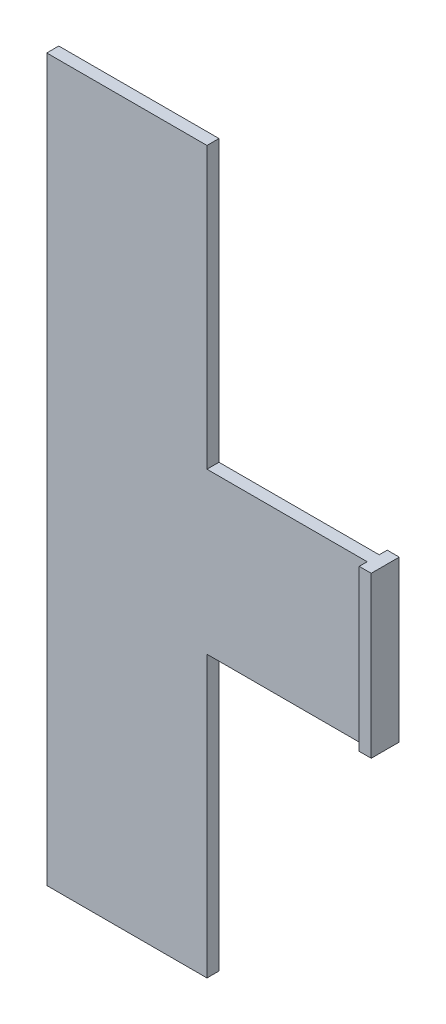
from build123d import *

# Parameters (mm, degrees)
SKETCH1_W           = 40
SKETCH1_H           = 3
BOSS_EXTRUDE1_DEPTH = 180
BOSS_EXTRUDE2_DEPTH = 20


with BuildPart() as part:
    # Sketch1 → Boss-Extrude1 (new body)
    with BuildSketch(Plane(origin=(0, 0, 0), x_dir=(1, 0, 0), z_dir=(0, 1, 0))):
        with Locations((-20, 1.5)):
            Rectangle(SKETCH1_W, SKETCH1_H)
    extrude(amount=BOSS_EXTRUDE1_DEPTH)

    # Sketch3 → Boss-Extrude2 (add, symmetric)
    with BuildSketch(Plane(origin=(0, 90, 0), x_dir=(1, 0, 0), z_dir=(0, 1, 0))):
        Polygon((40, 0), (40, -2), (43, -2), (43, 5), (40, 5), (40, 3), (0, 3), (0, 0), align=None)
    extrude(amount=BOSS_EXTRUDE2_DEPTH, both=True)


solid = part.part
